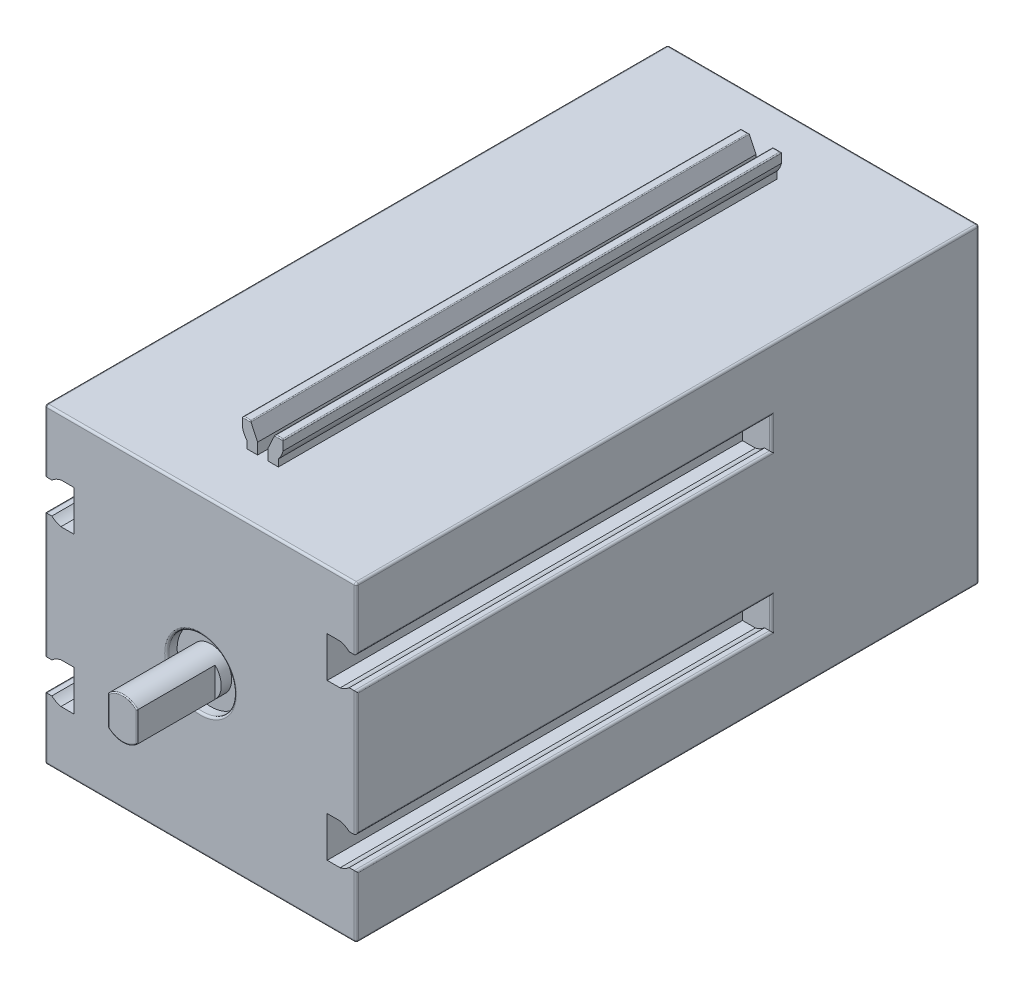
from build123d import *

# Parameters (mm, degrees)
SKETCH_1_W          = 30
SKETCH_1_H          = 30
EXTRUDE_1_DEPTH     = 60
CUT_EXTRUDE_1_DEPTH = 54.5
CUT_EXTRUDE_START   = -60
CUT_EXTRUDE_2_DEPTH = 40
EXTRUDE_START       = -6
EXTRUDE_2_DEPTH     = 48
FILLET_1_R          = 0.1
SKETCH_6_R          = 3.25
CUT_EXTRUDE_3_DEPTH = 1
SKETCH_7_R          = 2
EXTRUDE_3_DEPTH     = 8.5
CUT_EXTRUDE_START_2 = -7.5
CUT_EXTRUDE_5_DEPTH = 7.5
SKETCH_10_R         = 1.25
CUT_EXTRUDE_6_DEPTH = 5
CUT_EXTRUDE_7_DEPTH = 5
FILLET_2_R          = 0.2
FILLET_3_R          = 0.1


with BuildPart() as part:
    # Sketch 1 → Extrude 1 (new body)
    with BuildSketch(Plane.XY):
        with Locations((0, 15)):
            Rectangle(SKETCH_1_W, SKETCH_1_H)
    extrude(amount=-EXTRUDE_1_DEPTH)

    # Sketch 2 → Cut-Extrude 1 (cut)
    with BuildSketch(Plane(origin=(0, 0, -60), x_dir=(-1, 0, 0), z_dir=(0, 0, -1))):
        with BuildLine():
            Line((-9, 0.677124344), (-9, 0))
            Line((-9, 0), (-6, 0))
            Line((-6, 0), (-6, 0.677124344))
            ThreePointArc((-6, 0.677124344), (-5.719957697, 1.088161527), (-5.55, 1.555590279))
            Line((-5.55, 1.555590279), (-5.55, 2.8))
            Line((-5.55, 2.8), (-9.45, 2.8))
            Line((-9.45, 2.8), (-9.45, 1.555590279))
            ThreePointArc((-9.45, 1.555590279), (-9.280042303, 1.088161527), (-9, 0.677124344))
        make_face()
        with BuildLine():
            Line((5.55, 2.8), (5.55, 1.555590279))
            ThreePointArc((5.55, 1.555590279), (5.719957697, 1.088161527), (6, 0.677124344))
            Line((6, 0.677124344), (6, 0))
            Line((6, 0), (9, 0))
            Line((9, 0), (9, 0.677124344))
            ThreePointArc((9, 0.677124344), (9.280042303, 1.088161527), (9.45, 1.555590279))
            Line((9.45, 1.555590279), (9.45, 2.8))
            Line((9.45, 2.8), (5.55, 2.8))
        make_face()
    extrude(amount=-CUT_EXTRUDE_1_DEPTH, mode=Mode.SUBTRACT)

    # Sketch 3 → Cut-Extrude 2 (cut)
    with BuildSketch(Plane(origin=(0, 0, -60), x_dir=(-1, 0, 0), z_dir=(0, 0, -1)).offset(CUT_EXTRUDE_START)):
        with BuildLine():
            Line((-14.322875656, 9), (-15, 9))
            Line((-15, 9), (-15, 6))
            Line((-15, 6), (-14.322875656, 6))
            ThreePointArc((-14.322875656, 6), (-13.911838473, 5.719957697), (-13.444409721, 5.55))
            Line((-13.444409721, 5.55), (-12.2, 5.55))
            Line((-12.2, 5.55), (-12.2, 9.45))
            Line((-12.2, 9.45), (-13.444409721, 9.45))
            ThreePointArc((-13.444409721, 9.45), (-13.911838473, 9.280042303), (-14.322875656, 9))
        make_face()
        with BuildLine():
            Line((-12.2, 20.55), (-13.444409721, 20.55))
            ThreePointArc((-13.444409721, 20.55), (-13.911838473, 20.719957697), (-14.322875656, 21))
            Line((-14.322875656, 21), (-15, 21))
            Line((-15, 21), (-15, 24))
            Line((-15, 24), (-14.322875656, 24))
            ThreePointArc((-14.322875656, 24), (-13.911838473, 24.280042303), (-13.444409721, 24.45))
            Line((-13.444409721, 24.45), (-12.2, 24.45))
            Line((-12.2, 24.45), (-12.2, 20.55))
        make_face()
        with BuildLine():
            Line((14.322875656, 21), (15, 21))
            Line((15, 21), (15, 24))
            Line((15, 24), (14.322875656, 24))
            ThreePointArc((14.322875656, 24), (13.911838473, 24.280042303), (13.444409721, 24.45))
            Line((13.444409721, 24.45), (12.2, 24.45))
            Line((12.2, 24.45), (12.2, 20.55))
            Line((12.2, 20.55), (13.444409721, 20.55))
            ThreePointArc((13.444409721, 20.55), (13.911838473, 20.719957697), (14.322875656, 21))
        make_face()
        with BuildLine():
            Line((12.2, 9.45), (13.444409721, 9.45))
            ThreePointArc((13.444409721, 9.45), (13.911838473, 9.280042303), (14.322875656, 9))
            Line((14.322875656, 9), (15, 9))
            Line((15, 9), (15, 6))
            Line((15, 6), (14.322875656, 6))
            ThreePointArc((14.322875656, 6), (13.911838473, 5.719957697), (13.444409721, 5.55))
            Line((13.444409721, 5.55), (12.2, 5.55))
            Line((12.2, 5.55), (12.2, 9.45))
        make_face()
    extrude(amount=CUT_EXTRUDE_2_DEPTH, mode=Mode.SUBTRACT)

    # Sketch 5 → Extrude 2 (add)
    with BuildSketch(Plane(origin=(0, 0, -60), x_dir=(-1, 0, 0), z_dir=(0, 0, -1)).offset(EXTRUDE_START)):
        with BuildLine():
            Line((-1.5, 30.677124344), (-1.5, 30))
            Line((-1.5, 30), (-0.5, 30))
            Line((-0.5, 30), (-0.5, 31.07225346))
            Line((-0.5, 31.07225346), (-1.165769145, 32.5))
            Line((-1.165769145, 32.5), (-1.95, 32.5))
            Line((-1.95, 32.5), (-1.95, 31.555590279))
            ThreePointArc((-1.95, 31.555590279), (-1.780042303, 31.088161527), (-1.5, 30.677124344))
        make_face()
        with BuildLine():
            Line((1.5, 30), (1.5, 30.677124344))
            ThreePointArc((1.5, 30.677124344), (1.780042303, 31.088161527), (1.95, 31.555590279))
            Line((1.95, 31.555590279), (1.95, 32.5))
            Line((1.95, 32.5), (1.165769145, 32.5))
            Line((1.165769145, 32.5), (0.5, 31.07225346))
            Line((0.5, 31.07225346), (0.5, 30))
            Line((0.5, 30), (1.5, 30))
        make_face()
    extrude(amount=-EXTRUDE_2_DEPTH)

    # Fillet 1
    fillet_1_edges = [part.edges().sort_by_distance(p)[0] for p in [
        (1.557884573, 32.5, -6),
        (1.95, 32.5, -30),
        (1.165769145, 32.5, -30),
        (1.557884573, 32.5, -54),
        (-1.557884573, 32.5, -6),
        (-1.165769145, 32.5, -30),
        (-1.95, 32.5, -30),
        (-1.557884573, 32.5, -54),
    ]]
    fillet(fillet_1_edges, radius=FILLET_1_R)

    # Sketch 6 → Cut-Extrude 3 (cut)
    with BuildSketch(Plane.XY):
        with Locations((0, 15)):
            Circle(SKETCH_6_R)
    extrude(amount=-CUT_EXTRUDE_3_DEPTH, mode=Mode.SUBTRACT)

    # Sketch 7 → Extrude 3 (add)
    with BuildSketch(Plane.XY.offset(-1)):
        with Locations((0, 15)):
            Circle(SKETCH_7_R)
    extrude(amount=EXTRUDE_3_DEPTH)

    # Sketch 9 → Cut-Extrude 5 (cut)
    with BuildSketch(Plane.XY.offset(7.5).offset(CUT_EXTRUDE_START_2)):
        with BuildLine():
            Line((-1.4, 16.428285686), (-1.4, 13.571714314))
            ThreePointArc((-1.4, 13.571714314), (-2, 15), (-1.4, 16.428285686))
        make_face()
        with BuildLine():
            Line((1.4, 16.428285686), (1.4, 13.571714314))
            ThreePointArc((1.4, 13.571714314), (2, 15), (1.4, 16.428285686))
        make_face()
    extrude(amount=CUT_EXTRUDE_5_DEPTH, mode=Mode.SUBTRACT)

    # Sketch 10 → Cut-Extrude 6 (cut)
    with BuildSketch(Plane(origin=(0, 0, -60), x_dir=(-1, 0, 0), z_dir=(0, 0, -1))):
        with Locations((-10.5, 25.5)):
            Circle(SKETCH_10_R)
        with Locations((10.5, 25.5)):
            Circle(SKETCH_10_R)
    extrude(amount=-CUT_EXTRUDE_6_DEPTH, mode=Mode.SUBTRACT)

    # Sketch 11 → Cut-Extrude 7 (cut)
    with BuildSketch(Plane(origin=(0, 0, -60), x_dir=(-1, 0, 0), z_dir=(0, 0, -1))):
        Polygon((2.5, 24), (4, 24), (4, 27), (-4, 27), (-4, 24), (-2.5, 24), (-2.5, 25), (2.5, 25), align=None)
    extrude(amount=-CUT_EXTRUDE_7_DEPTH, mode=Mode.SUBTRACT)

    # Fillet 2
    fillet_2_edges = [part.edges().sort_by_distance(p)[0] for p in [
        (15, 15, -60),
        (-15, 15, 0),
        (-15, 21, -20),
        (-15, 24, -20),
        (-15, 22.5, -40),
        (-15, 3, 0),
        (0, 30, -60),
        (-15, 6, -20),
        (-15, 9, -20),
        (-15, 7.5, -40),
        (12, 0, -60),
        (7.5, 0, -5.5),
        (6, 0, -32.75),
        (9, 0, -32.75),
        (-3.25, 15, 0),
        (0, 0, -60),
        (-15, 15, -60),
        (-7.5, 0, -5.5),
        (-9, 0, -32.75),
        (-6, 0, -32.75),
        (0, 30, 0),
        (15, 3, 0),
        (0, 0, 0),
        (-15, 27, 0),
        (15, 15, 0),
        (15, 9, -20),
        (15, 6, -20),
        (-12, 0, -60),
        (15, 7.5, -40),
        (-15, 30, -30),
        (15, 30, -30),
        (15, 0, -30),
        (-15, 0, -30),
        (15, 27, 0),
        (15, 24, -20),
        (15, 21, -20),
        (15, 22.5, -40),
    ]]
    fillet(fillet_2_edges, radius=FILLET_2_R)

    # Fillet 3
    fillet_3_edges = [part.edges().sort_by_distance(p)[0] for p in [
        (0, 17, 7.5),
        (1.4, 15, 7.5),
        (0, 13, 7.5),
        (-1.4, 15, 7.5),
    ]]
    fillet(fillet_3_edges, radius=FILLET_3_R)


solid = part.part
